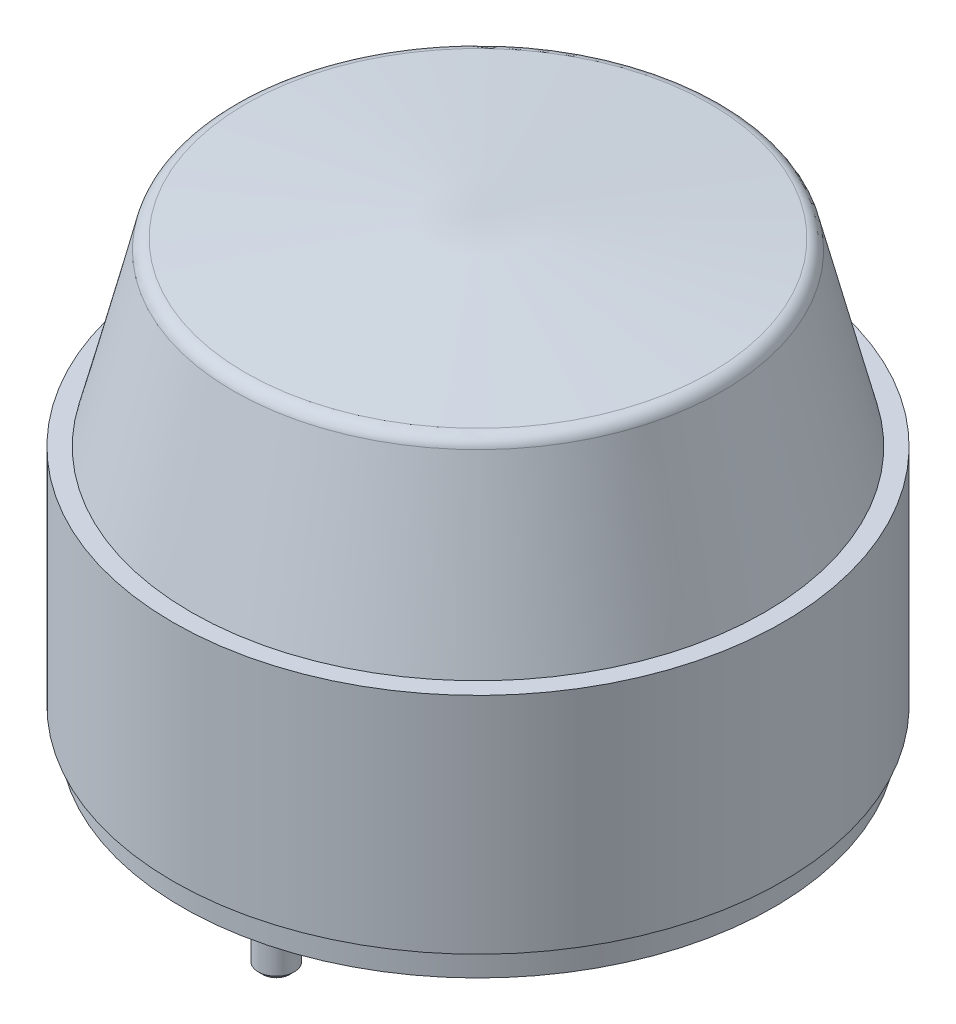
from build123d import *

# Parameters (mm, degrees)
CONG_1_R                = 1.5
ESQUISSE2_R             = 2
EXTRUSION1_DEPTH        = 11
ESQUISSE3_R             = 10
ENL_V_MAT_EXTRU_1_DEPTH = 3
CHANFREIN1_SIZE         = 0.5


with BuildPart() as part:
    # Esquisse1 → R_volution1 (revolve)
    with BuildSketch(Plane.XY, mode=Mode.PRIVATE) as r_volution1_sk:
        Polygon((0, 0), (33, 0), (33, 3), (34, 3), (34, 28), (32, 28), (27, 48), (0, 50.5), align=None)
    revolve(r_volution1_sk.sketch.rotate(Axis((0, 0, 0), (0, 1, 0)), 90), axis=Axis((0, 0, 0), (0, 1, 0)))

    # Cong_1
    cong_1_edges = [part.edges().sort_by_distance(p)[0] for p in [
        (0, 48, 27),
    ]]
    fillet(cong_1_edges, radius=CONG_1_R)

    # Esquisse2 → Extrusion1 (add)
    with BuildSketch(Plane.XZ):
        with Locations(Location((0, 22.5, 0), (0, 0, 270))):
            Circle(ESQUISSE2_R)
        with Locations(Location((0, -22.5, 0), (0, 0, 270))):
            Circle(ESQUISSE2_R)
    extrude(amount=EXTRUSION1_DEPTH)

    # Esquisse3 → Enl_v. mat.-Extru.1 (cut)
    with BuildSketch(Plane.XZ):
        with Locations(Location((0, 0, 0), (0, 0, 270))):
            Circle(ESQUISSE3_R)
    extrude(amount=-ENL_V_MAT_EXTRU_1_DEPTH, mode=Mode.SUBTRACT)

    # Chanfrein1
    chanfrein1_edges = [part.edges().sort_by_distance(p)[0] for p in [
        (0, -11, 24.5),
        (0, -11, -20.5),
    ]]
    chamfer(chanfrein1_edges, length=CHANFREIN1_SIZE)


solid = part.part
